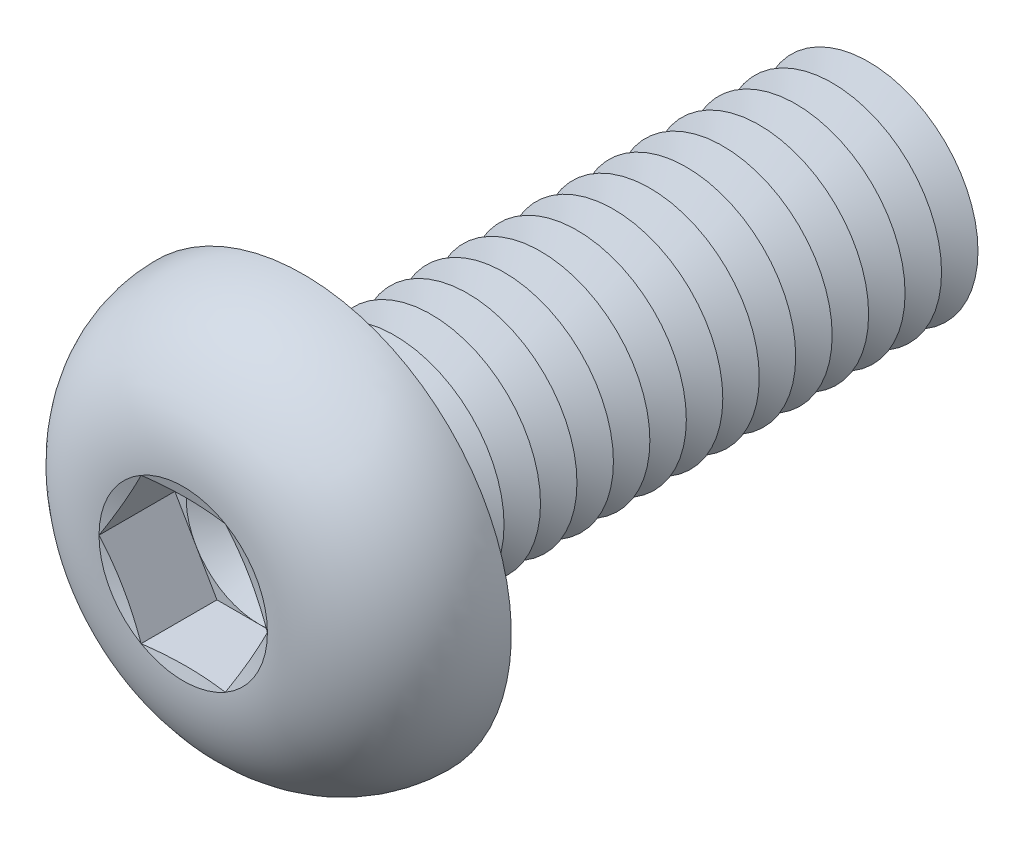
ISO-10303-21;
HEADER;
FILE_DESCRIPTION(('STEP AP214'),'2;1');
FILE_NAME('part.step','',(''),(''),'','','');
FILE_SCHEMA(('AUTOMOTIVE_DESIGN { 1 0 10303 214 1 1 1 1 }'));
ENDSEC;
DATA;
#1=APPLICATION_CONTEXT('core data for automotive mechanical design processes');
#2=APPLICATION_PROTOCOL_DEFINITION('international standard','automotive_design',2000,#1);
#3=PRODUCT_CONTEXT('',#1,'mechanical');
#4=PRODUCT('Part','Part','',(#3));
#5=PRODUCT_RELATED_PRODUCT_CATEGORY('part','',(#4));
#6=PRODUCT_DEFINITION_FORMATION('','',#4);
#7=PRODUCT_DEFINITION_CONTEXT('part definition',#1,'design');
#8=PRODUCT_DEFINITION('design','',#6,#7);
#9=PRODUCT_DEFINITION_SHAPE('','',#8);
#10=(LENGTH_UNIT() NAMED_UNIT(*) SI_UNIT(.MILLI.,.METRE.));
#11=(NAMED_UNIT(*) PLANE_ANGLE_UNIT() SI_UNIT($,.RADIAN.));
#12=(NAMED_UNIT(*) SI_UNIT($,.STERADIAN.) SOLID_ANGLE_UNIT());
#13=UNCERTAINTY_MEASURE_WITH_UNIT(LENGTH_MEASURE(1.E-05),#10,'distance_accuracy_value','');
#14=(GEOMETRIC_REPRESENTATION_CONTEXT(3) GLOBAL_UNCERTAINTY_ASSIGNED_CONTEXT((#13)) GLOBAL_UNIT_ASSIGNED_CONTEXT((#10,
#11,#12)) REPRESENTATION_CONTEXT('',''));
#15=CARTESIAN_POINT('',(0.,0.,0.));
#16=DIRECTION('',(0.,0.,1.));
#17=DIRECTION('',(1.,0.,0.));
#18=AXIS2_PLACEMENT_3D('',#15,#16,#17);
#19=CARTESIAN_POINT('',(0.,0.,0.609999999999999));
#20=DIRECTION('',(0.,0.,1.));
#21=DIRECTION('',(1.,0.,0.));
#22=AXIS2_PLACEMENT_3D('',#19,#20,#21);
#23=PLANE('',#22);
#24=CARTESIAN_POINT('',(0.,0.,0.609999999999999));
#25=DIRECTION('',(0.,0.,1.));
#26=DIRECTION('',(1.,0.,0.));
#27=AXIS2_PLACEMENT_3D('',#24,#25,#26);
#28=CIRCLE('',#27,0.999999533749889);
#29=CARTESIAN_POINT('',(0.866024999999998,0.499999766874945,0.609999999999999));
#30=VERTEX_POINT('',#29);
#31=CARTESIAN_POINT('',(0.,0.999999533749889,0.609999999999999));
#32=VERTEX_POINT('',#31);
#33=EDGE_CURVE('E118',#30,#32,#28,.T.);
#34=ORIENTED_EDGE('',*,*,#33,.F.);
#35=DIRECTION('',(-0.500000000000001,0.866025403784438,0.));
#36=VECTOR('',#35,1.);
#37=CARTESIAN_POINT('',(1.1547,0.,0.609999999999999));
#38=LINE('',#37,#36);
#39=CARTESIAN_POINT('',(0.577349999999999,0.999999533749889,0.609999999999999));
#40=VERTEX_POINT('',#39);
#41=EDGE_CURVE('E125',#30,#40,#38,.T.);
#42=ORIENTED_EDGE('',*,*,#41,.T.);
#43=DIRECTION('',(-1.,0.,0.));
#44=VECTOR('',#43,1.);
#45=CARTESIAN_POINT('',(0.577349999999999,0.999999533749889,0.609999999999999));
#46=LINE('',#45,#44);
#47=EDGE_CURVE('E136',#40,#32,#46,.T.);
#48=ORIENTED_EDGE('',*,*,#47,.T.);
#49=EDGE_LOOP('',(#34,#42,#48));
#50=FACE_BOUND('',#49,.T.);
#51=ADVANCED_FACE('F39',(#50),#23,.T.);
#52=CARTESIAN_POINT('',(0.,0.,0.609999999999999));
#53=DIRECTION('',(0.,0.,1.));
#54=DIRECTION('',(1.,0.,0.));
#55=AXIS2_PLACEMENT_3D('',#52,#53,#54);
#56=CIRCLE('',#55,0.999999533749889);
#57=CARTESIAN_POINT('',(-0.866024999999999,0.499999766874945,0.609999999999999));
#58=VERTEX_POINT('',#57);
#59=EDGE_CURVE('E11',#32,#58,#56,.T.);
#60=ORIENTED_EDGE('',*,*,#59,.F.);
#61=CARTESIAN_POINT('',(-0.577350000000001,0.999999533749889,0.609999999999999));
#62=VERTEX_POINT('',#61);
#63=EDGE_CURVE('E131',#32,#62,#46,.T.);
#64=ORIENTED_EDGE('',*,*,#63,.T.);
#65=DIRECTION('',(-0.5,-0.866025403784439,0.));
#66=VECTOR('',#65,1.);
#67=CARTESIAN_POINT('',(-0.577350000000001,0.999999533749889,0.609999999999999));
#68=LINE('',#67,#66);
#69=EDGE_CURVE('E134',#62,#58,#68,.T.);
#70=ORIENTED_EDGE('',*,*,#69,.T.);
#71=EDGE_LOOP('',(#60,#64,#70));
#72=FACE_BOUND('',#71,.T.);
#73=ADVANCED_FACE('F130',(#72),#23,.T.);
#74=CARTESIAN_POINT('',(-0.866024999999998,-0.499999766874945,0.609999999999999));
#75=VERTEX_POINT('',#74);
#76=EDGE_CURVE('E49',#58,#75,#56,.T.);
#77=ORIENTED_EDGE('',*,*,#76,.F.);
#78=CARTESIAN_POINT('',(-1.1547,0.,0.609999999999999));
#79=VERTEX_POINT('',#78);
#80=EDGE_CURVE('E143',#58,#79,#68,.T.);
#81=ORIENTED_EDGE('',*,*,#80,.T.);
#82=DIRECTION('',(0.5,-0.866025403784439,0.));
#83=VECTOR('',#82,1.);
#84=CARTESIAN_POINT('',(-1.1547,0.,0.609999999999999));
#85=LINE('',#84,#83);
#86=EDGE_CURVE('E152',#79,#75,#85,.T.);
#87=ORIENTED_EDGE('',*,*,#86,.T.);
#88=EDGE_LOOP('',(#77,#81,#87));
#89=FACE_BOUND('',#88,.T.);
#90=ADVANCED_FACE('F394',(#89),#23,.T.);
#91=CARTESIAN_POINT('',(0.,-0.999999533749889,0.609999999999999));
#92=VERTEX_POINT('',#91);
#93=EDGE_CURVE('E379',#75,#92,#56,.T.);
#94=ORIENTED_EDGE('',*,*,#93,.F.);
#95=CARTESIAN_POINT('',(-0.577349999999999,-0.99999953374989,0.609999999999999));
#96=VERTEX_POINT('',#95);
#97=EDGE_CURVE('E151',#75,#96,#85,.T.);
#98=ORIENTED_EDGE('',*,*,#97,.T.);
#99=DIRECTION('',(1.,0.,0.));
#100=VECTOR('',#99,1.);
#101=CARTESIAN_POINT('',(-0.577349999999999,-0.99999953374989,0.609999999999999));
#102=LINE('',#101,#100);
#103=EDGE_CURVE('E157',#96,#92,#102,.T.);
#104=ORIENTED_EDGE('',*,*,#103,.T.);
#105=EDGE_LOOP('',(#94,#98,#104));
#106=FACE_BOUND('',#105,.T.);
#107=ADVANCED_FACE('F387',(#106),#23,.T.);
#108=CARTESIAN_POINT('',(0.866024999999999,-0.499999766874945,0.609999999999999));
#109=VERTEX_POINT('',#108);
#110=EDGE_CURVE('E56',#92,#109,#56,.T.);
#111=ORIENTED_EDGE('',*,*,#110,.F.);
#112=CARTESIAN_POINT('',(0.577349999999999,-0.99999953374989,0.609999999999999));
#113=VERTEX_POINT('',#112);
#114=EDGE_CURVE('E156',#92,#113,#102,.T.);
#115=ORIENTED_EDGE('',*,*,#114,.T.);
#116=DIRECTION('',(0.5,0.866025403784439,0.));
#117=VECTOR('',#116,1.);
#118=CARTESIAN_POINT('',(0.577349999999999,-0.99999953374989,0.609999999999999));
#119=LINE('',#118,#117);
#120=EDGE_CURVE('E162',#113,#109,#119,.T.);
#121=ORIENTED_EDGE('',*,*,#120,.T.);
#122=EDGE_LOOP('',(#111,#115,#121));
#123=FACE_BOUND('',#122,.T.);
#124=ADVANCED_FACE('F462',(#123),#23,.T.);
#125=CARTESIAN_POINT('',(0.,0.,1.65));
#126=DIRECTION('',(0.,0.,1.));
#127=DIRECTION('',(1.,0.,0.));
#128=AXIS2_PLACEMENT_3D('',#125,#126,#127);
#129=CONICAL_SURFACE('',#128,1.1547,1.30899693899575);
#130=CARTESIAN_POINT('',(1.15481547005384,-0.000199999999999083,1.65003094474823));
#131=CARTESIAN_POINT('',(1.13083002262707,0.0413440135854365,1.64359970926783));
#132=CARTESIAN_POINT('',(1.10680107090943,0.0829633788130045,1.63776108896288));
#133=CARTESIAN_POINT('',(1.05865826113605,0.166349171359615,1.62750303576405));
#134=CARTESIAN_POINT('',(1.03454437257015,0.208115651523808,1.62308418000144));
#135=CARTESIAN_POINT('',(0.986377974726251,0.291542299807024,1.61592375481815));
#136=CARTESIAN_POINT('',(0.962325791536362,0.333201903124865,1.61317364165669));
#137=CARTESIAN_POINT('',(0.914190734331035,0.416574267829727,1.60948600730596));
#138=CARTESIAN_POINT('',(0.890107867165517,0.458287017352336,1.60854813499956));
#139=CARTESIAN_POINT('',(0.841942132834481,0.541712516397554,1.60854813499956));
#140=CARTESIAN_POINT('',(0.817859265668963,0.583425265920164,1.60948600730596));
#141=CARTESIAN_POINT('',(0.769724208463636,0.666797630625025,1.61317364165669));
#142=CARTESIAN_POINT('',(0.745672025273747,0.708457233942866,1.61592375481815));
#143=CARTESIAN_POINT('',(0.697505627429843,0.791883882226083,1.62308418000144));
#144=CARTESIAN_POINT('',(0.673391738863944,0.833650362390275,1.62750303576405));
#145=CARTESIAN_POINT('',(0.625248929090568,0.917036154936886,1.63776108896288));
#146=CARTESIAN_POINT('',(0.60121997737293,0.958655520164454,1.64359970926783));
#147=CARTESIAN_POINT('',(0.577234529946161,1.00019953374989,1.65003094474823));
#148=B_SPLINE_CURVE_WITH_KNOTS('',3,(#130,#131,#132,#133,#134,#135,#136,#137,#138,#139,#140,
#141,#142,#143,#144,#145,#146,#147),.UNSPECIFIED.,.F.,.F.,(4,2,2,2,2,2,2,2,4),(0.,
0.145207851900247,0.290474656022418,0.434991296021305,0.579479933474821,0.723968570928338,
0.868485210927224,1.0137520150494,1.15895986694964),.UNSPECIFIED.);
#149=CARTESIAN_POINT('',(1.1547,0.,1.65));
#150=VERTEX_POINT('',#149);
#151=CARTESIAN_POINT('',(0.57735,0.99999953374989,1.65));
#152=VERTEX_POINT('',#151);
#153=EDGE_CURVE('E221',#150,#152,#148,.T.);
#154=ORIENTED_EDGE('',*,*,#153,.F.);
#155=CARTESIAN_POINT('',(0.,0.,1.65));
#156=DIRECTION('',(0.,0.,-1.));
#157=DIRECTION('',(-1.,0.,0.));
#158=AXIS2_PLACEMENT_3D('',#155,#156,#157);
#159=CIRCLE('',#158,1.1547);
#160=EDGE_CURVE('E425',#152,#150,#159,.T.);
#161=ORIENTED_EDGE('',*,*,#160,.F.);
#162=EDGE_LOOP('',(#154,#161));
#163=FACE_BOUND('',#162,.T.);
#164=ADVANCED_FACE('F466',(#163),#129,.F.);
#165=CARTESIAN_POINT('',(0.577234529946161,-1.00019953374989,1.65003094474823));
#166=CARTESIAN_POINT('',(0.60121997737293,-0.958655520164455,1.64359970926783));
#167=CARTESIAN_POINT('',(0.625248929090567,-0.917036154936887,1.63776108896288));
#168=CARTESIAN_POINT('',(0.673391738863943,-0.833650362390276,1.62750303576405));
#169=CARTESIAN_POINT('',(0.697505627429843,-0.791883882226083,1.62308418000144));
#170=CARTESIAN_POINT('',(0.745672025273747,-0.708457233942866,1.61592375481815));
#171=CARTESIAN_POINT('',(0.769724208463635,-0.666797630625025,1.61317364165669));
#172=CARTESIAN_POINT('',(0.817859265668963,-0.583425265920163,1.60948600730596));
#173=CARTESIAN_POINT('',(0.84194213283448,-0.541712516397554,1.60854813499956));
#174=CARTESIAN_POINT('',(0.890107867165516,-0.458287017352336,1.60854813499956));
#175=CARTESIAN_POINT('',(0.914190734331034,-0.416574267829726,1.60948600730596));
#176=CARTESIAN_POINT('',(0.962325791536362,-0.333201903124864,1.61317364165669));
#177=CARTESIAN_POINT('',(0.98637797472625,-0.291542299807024,1.61592375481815));
#178=CARTESIAN_POINT('',(1.03454437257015,-0.208115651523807,1.62308418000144));
#179=CARTESIAN_POINT('',(1.05865826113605,-0.166349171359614,1.62750303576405));
#180=CARTESIAN_POINT('',(1.10680107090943,-0.0829633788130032,1.63776108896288));
#181=CARTESIAN_POINT('',(1.13083002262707,-0.0413440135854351,1.64359970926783));
#182=CARTESIAN_POINT('',(1.15481547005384,0.000200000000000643,1.65003094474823));
#183=B_SPLINE_CURVE_WITH_KNOTS('',3,(#165,#166,#167,#168,#169,#170,#171,#172,#173,#174,#175,
#176,#177,#178,#179,#180,#181,#182),.UNSPECIFIED.,.F.,.F.,(4,2,2,2,2,2,2,2,4),(0.,
0.145207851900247,0.290474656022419,0.434991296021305,0.579479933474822,0.723968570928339,
0.868485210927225,1.0137520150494,1.15895986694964),.UNSPECIFIED.);
#184=CARTESIAN_POINT('',(0.577349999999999,-0.99999953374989,1.65));
#185=VERTEX_POINT('',#184);
#186=EDGE_CURVE('E230',#185,#150,#183,.T.);
#187=ORIENTED_EDGE('',*,*,#186,.F.);
#188=EDGE_CURVE('E428',#150,#185,#159,.T.);
#189=ORIENTED_EDGE('',*,*,#188,.F.);
#190=EDGE_LOOP('',(#187,#189));
#191=FACE_BOUND('',#190,.T.);
#192=ADVANCED_FACE('F472',(#191),#129,.F.);
#193=CARTESIAN_POINT('',(-1.7425668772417,-0.99999953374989,1.87893949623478));
#194=CARTESIAN_POINT('',(-1.65819693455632,-0.99999953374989,1.85935934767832));
#195=CARTESIAN_POINT('',(-1.57375647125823,-0.99999953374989,1.84006351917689));
#196=CARTESIAN_POINT('',(-1.40464514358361,-0.99999953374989,1.80242908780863));
#197=CARTESIAN_POINT('',(-1.31997423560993,-0.99999953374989,1.78409068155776));
#198=CARTESIAN_POINT('',(-1.14955192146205,-0.99999953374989,1.74860242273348));
#199=CARTESIAN_POINT('',(-1.06379782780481,-0.99999953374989,1.73146532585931));
#200=CARTESIAN_POINT('',(-0.891887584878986,-0.99999953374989,1.69925819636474));
#201=CARTESIAN_POINT('',(-0.805731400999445,-0.99999953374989,1.68418834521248));
#202=CARTESIAN_POINT('',(-0.635256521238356,-0.99999953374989,1.65751615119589));
#203=CARTESIAN_POINT('',(-0.550951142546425,-0.99999953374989,1.64583105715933));
#204=CARTESIAN_POINT('',(-0.381865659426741,-0.99999953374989,1.62668811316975));
#205=CARTESIAN_POINT('',(-0.297085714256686,-0.99999953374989,1.61922892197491));
#206=CARTESIAN_POINT('',(-0.127577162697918,-0.99999953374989,1.60981453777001));
#207=CARTESIAN_POINT('',(-0.0428499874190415,-0.99999953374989,1.60783514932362));
#208=CARTESIAN_POINT('',(0.126542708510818,-0.99999953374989,1.60973012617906));
#209=CARTESIAN_POINT('',(0.211208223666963,-0.99999953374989,1.61360496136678));
#210=CARTESIAN_POINT('',(0.356115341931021,-0.99999953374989,1.62460226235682));
#211=CARTESIAN_POINT('',(0.416458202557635,-0.99999953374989,1.63048841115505));
#212=CARTESIAN_POINT('',(0.536893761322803,-0.99999953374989,1.64437752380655));
#213=CARTESIAN_POINT('',(0.596986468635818,-0.99999953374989,1.65238040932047));
#214=CARTESIAN_POINT('',(0.777275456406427,-0.99999953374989,1.67888855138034));
#215=CARTESIAN_POINT('',(0.897104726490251,-0.99999953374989,1.69985858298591));
#216=CARTESIAN_POINT('',(1.07751611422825,-0.99999953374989,1.73433574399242));
#217=CARTESIAN_POINT('',(1.1383777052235,-0.99999953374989,1.74646914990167));
#218=CARTESIAN_POINT('',(1.25994955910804,-0.99999953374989,1.7714845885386));
#219=CARTESIAN_POINT('',(1.32065982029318,-0.99999953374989,1.7843666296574));
#220=CARTESIAN_POINT('',(1.44162663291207,-0.99999953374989,1.81062164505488));
#221=CARTESIAN_POINT('',(1.50188385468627,-0.99999953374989,1.82399156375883));
#222=CARTESIAN_POINT('',(1.62229550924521,-0.99999953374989,1.85116781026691));
#223=CARTESIAN_POINT('',(1.68244994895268,-0.99999953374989,1.86497410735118));
#224=CARTESIAN_POINT('',(1.7425668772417,-0.99999953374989,1.87893949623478));
#225=B_SPLINE_CURVE_WITH_KNOTS('',3,(#193,#194,#195,#196,#197,#198,#199,#200,#201,#202,#203,
#204,#205,#206,#207,#208,#209,#210,#211,#212,#213,#214,#215,#216,#217,#218,#219,#220,#221,#222,
#223,#224),.UNSPECIFIED.,.F.,.F.,(4,2,2,2,2,2,2,2,2,2,2,2,2,2,2,4),(0.,0.259842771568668,
0.519738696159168,0.782071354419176,1.04442702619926,1.29968778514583,1.55486748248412,
1.80891865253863,2.06299021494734,2.24483732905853,2.42667771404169,2.79149503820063,
2.97767344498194,3.16385393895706,3.34902052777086,3.53417411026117),.UNSPECIFIED.);
#226=CARTESIAN_POINT('',(-0.577349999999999,-0.99999953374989,1.65));
#227=VERTEX_POINT('',#226);
#228=EDGE_CURVE('E406',#227,#185,#225,.T.);
#229=ORIENTED_EDGE('',*,*,#228,.F.);
#230=EDGE_CURVE('E414',#185,#227,#159,.T.);
#231=ORIENTED_EDGE('',*,*,#230,.F.);
#232=EDGE_LOOP('',(#229,#231));
#233=FACE_BOUND('',#232,.T.);
#234=ADVANCED_FACE('F487',(#233),#129,.F.);
#235=CARTESIAN_POINT('',(-1.15481547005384,0.000200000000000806,1.65003094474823));
#236=CARTESIAN_POINT('',(-1.13083002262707,-0.041344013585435,1.64359970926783));
#237=CARTESIAN_POINT('',(-1.10680107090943,-0.0829633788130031,1.63776108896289));
#238=CARTESIAN_POINT('',(-1.05865826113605,-0.166349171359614,1.62750303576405));
#239=CARTESIAN_POINT('',(-1.03454437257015,-0.208115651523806,1.62308418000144));
#240=CARTESIAN_POINT('',(-0.986377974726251,-0.291542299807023,1.61592375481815));
#241=CARTESIAN_POINT('',(-0.962325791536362,-0.333201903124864,1.61317364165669));
#242=CARTESIAN_POINT('',(-0.914190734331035,-0.416574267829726,1.60948600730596));
#243=CARTESIAN_POINT('',(-0.890107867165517,-0.458287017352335,1.60854813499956));
#244=CARTESIAN_POINT('',(-0.841942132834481,-0.541712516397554,1.60854813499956));
#245=CARTESIAN_POINT('',(-0.817859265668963,-0.583425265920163,1.60948600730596));
#246=CARTESIAN_POINT('',(-0.769724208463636,-0.666797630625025,1.61317364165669));
#247=CARTESIAN_POINT('',(-0.745672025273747,-0.708457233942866,1.61592375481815));
#248=CARTESIAN_POINT('',(-0.697505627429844,-0.791883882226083,1.62308418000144));
#249=CARTESIAN_POINT('',(-0.673391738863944,-0.833650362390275,1.62750303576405));
#250=CARTESIAN_POINT('',(-0.625248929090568,-0.917036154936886,1.63776108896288));
#251=CARTESIAN_POINT('',(-0.60121997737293,-0.958655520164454,1.64359970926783));
#252=CARTESIAN_POINT('',(-0.577234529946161,-1.00019953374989,1.65003094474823));
#253=B_SPLINE_CURVE_WITH_KNOTS('',3,(#235,#236,#237,#238,#239,#240,#241,#242,#243,#244,#245,
#246,#247,#248,#249,#250,#251,#252),.UNSPECIFIED.,.F.,.F.,(4,2,2,2,2,2,2,2,4),(0.,
0.145207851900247,0.290474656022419,0.434991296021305,0.579479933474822,0.723968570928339,
0.868485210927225,1.0137520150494,1.15895986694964),.UNSPECIFIED.);
#254=CARTESIAN_POINT('',(-1.1547,0.,1.65));
#255=VERTEX_POINT('',#254);
#256=EDGE_CURVE('E399',#255,#227,#253,.T.);
#257=ORIENTED_EDGE('',*,*,#256,.F.);
#258=EDGE_CURVE('E364',#227,#255,#159,.T.);
#259=ORIENTED_EDGE('',*,*,#258,.F.);
#260=EDGE_LOOP('',(#257,#259));
#261=FACE_BOUND('',#260,.T.);
#262=ADVANCED_FACE('F403',(#261),#129,.F.);
#263=CARTESIAN_POINT('',(-0.577234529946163,1.00019953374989,1.65003094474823));
#264=CARTESIAN_POINT('',(-0.601219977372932,0.958655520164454,1.64359970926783));
#265=CARTESIAN_POINT('',(-0.625248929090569,0.917036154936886,1.63776108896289));
#266=CARTESIAN_POINT('',(-0.673391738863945,0.833650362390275,1.62750303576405));
#267=CARTESIAN_POINT('',(-0.697505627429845,0.791883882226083,1.62308418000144));
#268=CARTESIAN_POINT('',(-0.745672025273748,0.708457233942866,1.61592375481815));
#269=CARTESIAN_POINT('',(-0.769724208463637,0.666797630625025,1.61317364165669));
#270=CARTESIAN_POINT('',(-0.817859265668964,0.583425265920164,1.60948600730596));
#271=CARTESIAN_POINT('',(-0.841942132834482,0.541712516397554,1.60854813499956));
#272=CARTESIAN_POINT('',(-0.890107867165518,0.458287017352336,1.60854813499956));
#273=CARTESIAN_POINT('',(-0.914190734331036,0.416574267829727,1.60948600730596));
#274=CARTESIAN_POINT('',(-0.962325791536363,0.333201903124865,1.61317364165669));
#275=CARTESIAN_POINT('',(-0.986377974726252,0.291542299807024,1.61592375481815));
#276=CARTESIAN_POINT('',(-1.03454437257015,0.208115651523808,1.62308418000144));
#277=CARTESIAN_POINT('',(-1.05865826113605,0.166349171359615,1.62750303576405));
#278=CARTESIAN_POINT('',(-1.10680107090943,0.0829633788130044,1.63776108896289));
#279=CARTESIAN_POINT('',(-1.13083002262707,0.0413440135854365,1.64359970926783));
#280=CARTESIAN_POINT('',(-1.15481547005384,-0.000199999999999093,1.65003094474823));
#281=B_SPLINE_CURVE_WITH_KNOTS('',3,(#263,#264,#265,#266,#267,#268,#269,#270,#271,#272,#273,
#274,#275,#276,#277,#278,#279,#280),.UNSPECIFIED.,.F.,.F.,(4,2,2,2,2,2,2,2,4),(0.,
0.145207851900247,0.290474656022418,0.434991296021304,0.579479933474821,0.723968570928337,
0.868485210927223,1.01375201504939,1.15895986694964),.UNSPECIFIED.);
#282=CARTESIAN_POINT('',(-0.577350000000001,0.999999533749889,1.65));
#283=VERTEX_POINT('',#282);
#284=EDGE_CURVE('E195',#283,#255,#281,.T.);
#285=ORIENTED_EDGE('',*,*,#284,.F.);
#286=EDGE_CURVE('E365',#255,#283,#159,.T.);
#287=ORIENTED_EDGE('',*,*,#286,.F.);
#288=EDGE_LOOP('',(#285,#287));
#289=FACE_BOUND('',#288,.T.);
#290=ADVANCED_FACE('F417',(#289),#129,.F.);
#291=CARTESIAN_POINT('',(0.,0.,-6.25));
#292=DIRECTION('',(0.,0.,1.));
#293=DIRECTION('',(1.,0.,0.));
#294=AXIS2_PLACEMENT_3D('',#291,#292,#293);
#295=CONICAL_SURFACE('',#294,1.5,1.0471975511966);
#296=CARTESIAN_POINT('',(0.,0.,-6.5));
#297=DIRECTION('',(0.,0.,1.));
#298=DIRECTION('',(1.,0.,0.));
#299=AXIS2_PLACEMENT_3D('',#296,#297,#298);
#300=CIRCLE('',#299,1.06698729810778);
#301=CARTESIAN_POINT('',(1.06698729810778,0.,-6.5));
#302=VERTEX_POINT('',#301);
#303=EDGE_CURVE('E336',#302,#302,#300,.T.);
#304=ORIENTED_EDGE('',*,*,#303,.T.);
#305=EDGE_LOOP('',(#304));
#306=FACE_BOUND('',#305,.T.);
#307=CARTESIAN_POINT('',(0.,0.,-6.25));
#308=DIRECTION('',(0.,0.,1.));
#309=DIRECTION('',(1.,0.,0.));
#310=AXIS2_PLACEMENT_3D('',#307,#308,#309);
#311=CIRCLE('',#310,1.5);
#312=CARTESIAN_POINT('',(1.5,0.,-6.25));
#313=VERTEX_POINT('',#312);
#314=EDGE_CURVE('E332',#313,#313,#311,.T.);
#315=ORIENTED_EDGE('',*,*,#314,.F.);
#316=EDGE_LOOP('',(#315));
#317=FACE_BOUND('',#316,.T.);
#318=ADVANCED_FACE('F553',(#306,#317),#295,.T.);
#319=CARTESIAN_POINT('',(0.,0.,-6.5));
#320=DIRECTION('',(0.,0.,-1.));
#321=DIRECTION('',(-1.,0.,0.));
#322=AXIS2_PLACEMENT_3D('',#319,#320,#321);
#323=CONICAL_SURFACE('',#322,1.06698729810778,1.0471975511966);
#324=CARTESIAN_POINT('',(0.,0.,-6.75));
#325=DIRECTION('',(0.,0.,1.));
#326=DIRECTION('',(1.,0.,0.));
#327=AXIS2_PLACEMENT_3D('',#324,#325,#326);
#328=CIRCLE('',#327,1.5);
#329=CARTESIAN_POINT('',(1.5,0.,-6.75));
#330=VERTEX_POINT('',#329);
#331=EDGE_CURVE('E340',#330,#330,#328,.T.);
#332=ORIENTED_EDGE('',*,*,#331,.T.);
#333=EDGE_LOOP('',(#332));
#334=FACE_BOUND('',#333,.T.);
#335=ORIENTED_EDGE('',*,*,#303,.F.);
#336=EDGE_LOOP('',(#335));
#337=FACE_BOUND('',#336,.T.);
#338=ADVANCED_FACE('F848',(#334,#337),#323,.T.);
#339=CARTESIAN_POINT('',(0.,1.5,-8.));
#340=DIRECTION('',(0.,0.,-1.));
#341=DIRECTION('',(-1.,0.,0.));
#342=AXIS2_PLACEMENT_3D('',#339,#340,#341);
#343=PLANE('',#342);
#344=CARTESIAN_POINT('',(0.,0.,-8.));
#345=DIRECTION('',(0.,0.,1.));
#346=DIRECTION('',(1.,0.,0.));
#347=AXIS2_PLACEMENT_3D('',#344,#345,#346);
#348=CIRCLE('',#347,1.06698729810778);
#349=CARTESIAN_POINT('',(1.06698729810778,0.,-8.));
#350=VERTEX_POINT('',#349);
#351=EDGE_CURVE('E360',#350,#350,#348,.T.);
#352=ORIENTED_EDGE('',*,*,#351,.F.);
#353=EDGE_LOOP('',(#352));
#354=FACE_BOUND('',#353,.T.);
#355=ADVANCED_FACE('F842',(#354),#343,.T.);
#356=CARTESIAN_POINT('',(0.,0.,-7.75));
#357=DIRECTION('',(0.,0.,1.));
#358=DIRECTION('',(1.,0.,0.));
#359=AXIS2_PLACEMENT_3D('',#356,#357,#358);
#360=CONICAL_SURFACE('',#359,1.5,1.0471975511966);
#361=ORIENTED_EDGE('',*,*,#351,.T.);
#362=EDGE_LOOP('',(#361));
#363=FACE_BOUND('',#362,.T.);
#364=CARTESIAN_POINT('',(0.,0.,-7.75));
#365=DIRECTION('',(0.,0.,1.));
#366=DIRECTION('',(1.,0.,0.));
#367=AXIS2_PLACEMENT_3D('',#364,#365,#366);
#368=CIRCLE('',#367,1.5);
#369=CARTESIAN_POINT('',(1.5,0.,-7.75));
#370=VERTEX_POINT('',#369);
#371=EDGE_CURVE('E356',#370,#370,#368,.T.);
#372=ORIENTED_EDGE('',*,*,#371,.F.);
#373=EDGE_LOOP('',(#372));
#374=FACE_BOUND('',#373,.T.);
#375=ADVANCED_FACE('F835',(#363,#374),#360,.T.);
#376=CARTESIAN_POINT('',(0.,0.,-7.5));
#377=DIRECTION('',(0.,0.,-1.));
#378=DIRECTION('',(-1.,0.,0.));
#379=AXIS2_PLACEMENT_3D('',#376,#377,#378);
#380=CONICAL_SURFACE('',#379,1.06698729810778,1.0471975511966);
#381=ORIENTED_EDGE('',*,*,#371,.T.);
#382=EDGE_LOOP('',(#381));
#383=FACE_BOUND('',#382,.T.);
#384=CARTESIAN_POINT('',(0.,0.,-7.5));
#385=DIRECTION('',(0.,0.,1.));
#386=DIRECTION('',(1.,0.,0.));
#387=AXIS2_PLACEMENT_3D('',#384,#385,#386);
#388=CIRCLE('',#387,1.06698729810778);
#389=CARTESIAN_POINT('',(1.06698729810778,0.,-7.5));
#390=VERTEX_POINT('',#389);
#391=EDGE_CURVE('E352',#390,#390,#388,.T.);
#392=ORIENTED_EDGE('',*,*,#391,.F.);
#393=EDGE_LOOP('',(#392));
#394=FACE_BOUND('',#393,.T.);
#395=ADVANCED_FACE('F828',(#383,#394),#380,.T.);
#396=CARTESIAN_POINT('',(0.,0.,-7.25));
#397=DIRECTION('',(0.,0.,1.));
#398=DIRECTION('',(1.,0.,0.));
#399=AXIS2_PLACEMENT_3D('',#396,#397,#398);
#400=CONICAL_SURFACE('',#399,1.5,1.0471975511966);
#401=ORIENTED_EDGE('',*,*,#391,.T.);
#402=EDGE_LOOP('',(#401));
#403=FACE_BOUND('',#402,.T.);
#404=CARTESIAN_POINT('',(0.,0.,-7.25));
#405=DIRECTION('',(0.,0.,1.));
#406=DIRECTION('',(1.,0.,0.));
#407=AXIS2_PLACEMENT_3D('',#404,#405,#406);
#408=CIRCLE('',#407,1.5);
#409=CARTESIAN_POINT('',(1.5,0.,-7.25));
#410=VERTEX_POINT('',#409);
#411=EDGE_CURVE('E348',#410,#410,#408,.T.);
#412=ORIENTED_EDGE('',*,*,#411,.F.);
#413=EDGE_LOOP('',(#412));
#414=FACE_BOUND('',#413,.T.);
#415=ADVANCED_FACE('F821',(#403,#414),#400,.T.);
#416=CARTESIAN_POINT('',(0.,0.,-7.));
#417=DIRECTION('',(0.,0.,-1.));
#418=DIRECTION('',(-1.,0.,0.));
#419=AXIS2_PLACEMENT_3D('',#416,#417,#418);
#420=CONICAL_SURFACE('',#419,1.06698729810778,1.0471975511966);
#421=ORIENTED_EDGE('',*,*,#411,.T.);
#422=EDGE_LOOP('',(#421));
#423=FACE_BOUND('',#422,.T.);
#424=CARTESIAN_POINT('',(0.,0.,-7.));
#425=DIRECTION('',(0.,0.,1.));
#426=DIRECTION('',(1.,0.,0.));
#427=AXIS2_PLACEMENT_3D('',#424,#425,#426);
#428=CIRCLE('',#427,1.06698729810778);
#429=CARTESIAN_POINT('',(1.06698729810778,0.,-7.));
#430=VERTEX_POINT('',#429);
#431=EDGE_CURVE('E344',#430,#430,#428,.T.);
#432=ORIENTED_EDGE('',*,*,#431,.F.);
#433=EDGE_LOOP('',(#432));
#434=FACE_BOUND('',#433,.T.);
#435=ADVANCED_FACE('F814',(#423,#434),#420,.T.);
#436=CARTESIAN_POINT('',(0.,0.,-6.75));
#437=DIRECTION('',(0.,0.,1.));
#438=DIRECTION('',(1.,0.,0.));
#439=AXIS2_PLACEMENT_3D('',#436,#437,#438);
#440=CONICAL_SURFACE('',#439,1.5,1.0471975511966);
#441=ORIENTED_EDGE('',*,*,#431,.T.);
#442=EDGE_LOOP('',(#441));
#443=FACE_BOUND('',#442,.T.);
#444=ORIENTED_EDGE('',*,*,#331,.F.);
#445=EDGE_LOOP('',(#444));
#446=FACE_BOUND('',#445,.T.);
#447=ADVANCED_FACE('F807',(#443,#446),#440,.T.);
#448=CARTESIAN_POINT('',(0.,0.,-5.75));
#449=DIRECTION('',(0.,0.,1.));
#450=DIRECTION('',(1.,0.,0.));
#451=AXIS2_PLACEMENT_3D('',#448,#449,#450);
#452=CONICAL_SURFACE('',#451,1.5,1.0471975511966);
#453=CARTESIAN_POINT('',(0.,0.,-6.));
#454=DIRECTION('',(0.,0.,1.));
#455=DIRECTION('',(1.,0.,0.));
#456=AXIS2_PLACEMENT_3D('',#453,#454,#455);
#457=CIRCLE('',#456,1.06698729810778);
#458=CARTESIAN_POINT('',(1.06698729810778,0.,-6.));
#459=VERTEX_POINT('',#458);
#460=EDGE_CURVE('E328',#459,#459,#457,.T.);
#461=ORIENTED_EDGE('',*,*,#460,.T.);
#462=EDGE_LOOP('',(#461));
#463=FACE_BOUND('',#462,.T.);
#464=CARTESIAN_POINT('',(0.,0.,-5.75));
#465=DIRECTION('',(0.,0.,1.));
#466=DIRECTION('',(1.,0.,0.));
#467=AXIS2_PLACEMENT_3D('',#464,#465,#466);
#468=CIRCLE('',#467,1.5);
#469=CARTESIAN_POINT('',(1.5,0.,-5.75));
#470=VERTEX_POINT('',#469);
#471=EDGE_CURVE('E324',#470,#470,#468,.T.);
#472=ORIENTED_EDGE('',*,*,#471,.F.);
#473=EDGE_LOOP('',(#472));
#474=FACE_BOUND('',#473,.T.);
#475=ADVANCED_FACE('F800',(#463,#474),#452,.T.);
#476=CARTESIAN_POINT('',(0.,0.,-6.));
#477=DIRECTION('',(0.,0.,-1.));
#478=DIRECTION('',(-1.,0.,0.));
#479=AXIS2_PLACEMENT_3D('',#476,#477,#478);
#480=CONICAL_SURFACE('',#479,1.06698729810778,1.0471975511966);
#481=ORIENTED_EDGE('',*,*,#314,.T.);
#482=EDGE_LOOP('',(#481));
#483=FACE_BOUND('',#482,.T.);
#484=ORIENTED_EDGE('',*,*,#460,.F.);
#485=EDGE_LOOP('',(#484));
#486=FACE_BOUND('',#485,.T.);
#487=ADVANCED_FACE('F793',(#483,#486),#480,.T.);
#488=CARTESIAN_POINT('',(0.,0.,-5.25));
#489=DIRECTION('',(0.,0.,1.));
#490=DIRECTION('',(1.,0.,0.));
#491=AXIS2_PLACEMENT_3D('',#488,#489,#490);
#492=CONICAL_SURFACE('',#491,1.5,1.0471975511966);
#493=CARTESIAN_POINT('',(0.,0.,-5.5));
#494=DIRECTION('',(0.,0.,1.));
#495=DIRECTION('',(1.,0.,0.));
#496=AXIS2_PLACEMENT_3D('',#493,#494,#495);
#497=CIRCLE('',#496,1.06698729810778);
#498=CARTESIAN_POINT('',(1.06698729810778,0.,-5.5));
#499=VERTEX_POINT('',#498);
#500=EDGE_CURVE('E320',#499,#499,#497,.T.);
#501=ORIENTED_EDGE('',*,*,#500,.T.);
#502=EDGE_LOOP('',(#501));
#503=FACE_BOUND('',#502,.T.);
#504=CARTESIAN_POINT('',(0.,0.,-5.25));
#505=DIRECTION('',(0.,0.,1.));
#506=DIRECTION('',(1.,0.,0.));
#507=AXIS2_PLACEMENT_3D('',#504,#505,#506);
#508=CIRCLE('',#507,1.5);
#509=CARTESIAN_POINT('',(1.5,0.,-5.25));
#510=VERTEX_POINT('',#509);
#511=EDGE_CURVE('E316',#510,#510,#508,.T.);
#512=ORIENTED_EDGE('',*,*,#511,.F.);
#513=EDGE_LOOP('',(#512));
#514=FACE_BOUND('',#513,.T.);
#515=ADVANCED_FACE('F786',(#503,#514),#492,.T.);
#516=CARTESIAN_POINT('',(0.,0.,-5.5));
#517=DIRECTION('',(0.,0.,-1.));
#518=DIRECTION('',(-1.,0.,0.));
#519=AXIS2_PLACEMENT_3D('',#516,#517,#518);
#520=CONICAL_SURFACE('',#519,1.06698729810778,1.0471975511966);
#521=ORIENTED_EDGE('',*,*,#471,.T.);
#522=EDGE_LOOP('',(#521));
#523=FACE_BOUND('',#522,.T.);
#524=ORIENTED_EDGE('',*,*,#500,.F.);
#525=EDGE_LOOP('',(#524));
#526=FACE_BOUND('',#525,.T.);
#527=ADVANCED_FACE('F779',(#523,#526),#520,.T.);
#528=CARTESIAN_POINT('',(0.,0.,-4.75));
#529=DIRECTION('',(0.,0.,1.));
#530=DIRECTION('',(1.,0.,0.));
#531=AXIS2_PLACEMENT_3D('',#528,#529,#530);
#532=CONICAL_SURFACE('',#531,1.5,1.0471975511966);
#533=CARTESIAN_POINT('',(0.,0.,-5.));
#534=DIRECTION('',(0.,0.,1.));
#535=DIRECTION('',(1.,0.,0.));
#536=AXIS2_PLACEMENT_3D('',#533,#534,#535);
#537=CIRCLE('',#536,1.06698729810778);
#538=CARTESIAN_POINT('',(1.06698729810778,0.,-5.));
#539=VERTEX_POINT('',#538);
#540=EDGE_CURVE('E312',#539,#539,#537,.T.);
#541=ORIENTED_EDGE('',*,*,#540,.T.);
#542=EDGE_LOOP('',(#541));
#543=FACE_BOUND('',#542,.T.);
#544=CARTESIAN_POINT('',(0.,0.,-4.75));
#545=DIRECTION('',(0.,0.,1.));
#546=DIRECTION('',(1.,0.,0.));
#547=AXIS2_PLACEMENT_3D('',#544,#545,#546);
#548=CIRCLE('',#547,1.5);
#549=CARTESIAN_POINT('',(1.5,0.,-4.75));
#550=VERTEX_POINT('',#549);
#551=EDGE_CURVE('E308',#550,#550,#548,.T.);
#552=ORIENTED_EDGE('',*,*,#551,.F.);
#553=EDGE_LOOP('',(#552));
#554=FACE_BOUND('',#553,.T.);
#555=ADVANCED_FACE('F772',(#543,#554),#532,.T.);
#556=CARTESIAN_POINT('',(0.,0.,-5.));
#557=DIRECTION('',(0.,0.,-1.));
#558=DIRECTION('',(-1.,0.,0.));
#559=AXIS2_PLACEMENT_3D('',#556,#557,#558);
#560=CONICAL_SURFACE('',#559,1.06698729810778,1.0471975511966);
#561=ORIENTED_EDGE('',*,*,#511,.T.);
#562=EDGE_LOOP('',(#561));
#563=FACE_BOUND('',#562,.T.);
#564=ORIENTED_EDGE('',*,*,#540,.F.);
#565=EDGE_LOOP('',(#564));
#566=FACE_BOUND('',#565,.T.);
#567=ADVANCED_FACE('F765',(#563,#566),#560,.T.);
#568=CARTESIAN_POINT('',(0.,0.,-4.25));
#569=DIRECTION('',(0.,0.,1.));
#570=DIRECTION('',(1.,0.,0.));
#571=AXIS2_PLACEMENT_3D('',#568,#569,#570);
#572=CONICAL_SURFACE('',#571,1.5,1.0471975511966);
#573=CARTESIAN_POINT('',(0.,0.,-4.5));
#574=DIRECTION('',(0.,0.,1.));
#575=DIRECTION('',(1.,0.,0.));
#576=AXIS2_PLACEMENT_3D('',#573,#574,#575);
#577=CIRCLE('',#576,1.06698729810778);
#578=CARTESIAN_POINT('',(1.06698729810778,0.,-4.5));
#579=VERTEX_POINT('',#578);
#580=EDGE_CURVE('E304',#579,#579,#577,.T.);
#581=ORIENTED_EDGE('',*,*,#580,.T.);
#582=EDGE_LOOP('',(#581));
#583=FACE_BOUND('',#582,.T.);
#584=CARTESIAN_POINT('',(0.,0.,-4.25));
#585=DIRECTION('',(0.,0.,1.));
#586=DIRECTION('',(1.,0.,0.));
#587=AXIS2_PLACEMENT_3D('',#584,#585,#586);
#588=CIRCLE('',#587,1.5);
#589=CARTESIAN_POINT('',(1.5,0.,-4.25));
#590=VERTEX_POINT('',#589);
#591=EDGE_CURVE('E300',#590,#590,#588,.T.);
#592=ORIENTED_EDGE('',*,*,#591,.F.);
#593=EDGE_LOOP('',(#592));
#594=FACE_BOUND('',#593,.T.);
#595=ADVANCED_FACE('F758',(#583,#594),#572,.T.);
#596=CARTESIAN_POINT('',(0.,0.,-4.5));
#597=DIRECTION('',(0.,0.,-1.));
#598=DIRECTION('',(-1.,0.,0.));
#599=AXIS2_PLACEMENT_3D('',#596,#597,#598);
#600=CONICAL_SURFACE('',#599,1.06698729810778,1.0471975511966);
#601=ORIENTED_EDGE('',*,*,#551,.T.);
#602=EDGE_LOOP('',(#601));
#603=FACE_BOUND('',#602,.T.);
#604=ORIENTED_EDGE('',*,*,#580,.F.);
#605=EDGE_LOOP('',(#604));
#606=FACE_BOUND('',#605,.T.);
#607=ADVANCED_FACE('F751',(#603,#606),#600,.T.);
#608=CARTESIAN_POINT('',(0.,0.,-3.75));
#609=DIRECTION('',(0.,0.,1.));
#610=DIRECTION('',(1.,0.,0.));
#611=AXIS2_PLACEMENT_3D('',#608,#609,#610);
#612=CONICAL_SURFACE('',#611,1.5,1.0471975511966);
#613=CARTESIAN_POINT('',(0.,0.,-4.));
#614=DIRECTION('',(0.,0.,1.));
#615=DIRECTION('',(1.,0.,0.));
#616=AXIS2_PLACEMENT_3D('',#613,#614,#615);
#617=CIRCLE('',#616,1.06698729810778);
#618=CARTESIAN_POINT('',(1.06698729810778,0.,-4.));
#619=VERTEX_POINT('',#618);
#620=EDGE_CURVE('E296',#619,#619,#617,.T.);
#621=ORIENTED_EDGE('',*,*,#620,.T.);
#622=EDGE_LOOP('',(#621));
#623=FACE_BOUND('',#622,.T.);
#624=CARTESIAN_POINT('',(0.,0.,-3.75));
#625=DIRECTION('',(0.,0.,1.));
#626=DIRECTION('',(1.,0.,0.));
#627=AXIS2_PLACEMENT_3D('',#624,#625,#626);
#628=CIRCLE('',#627,1.5);
#629=CARTESIAN_POINT('',(1.5,0.,-3.75));
#630=VERTEX_POINT('',#629);
#631=EDGE_CURVE('E292',#630,#630,#628,.T.);
#632=ORIENTED_EDGE('',*,*,#631,.F.);
#633=EDGE_LOOP('',(#632));
#634=FACE_BOUND('',#633,.T.);
#635=ADVANCED_FACE('F744',(#623,#634),#612,.T.);
#636=CARTESIAN_POINT('',(0.,0.,-4.));
#637=DIRECTION('',(0.,0.,-1.));
#638=DIRECTION('',(-1.,0.,0.));
#639=AXIS2_PLACEMENT_3D('',#636,#637,#638);
#640=CONICAL_SURFACE('',#639,1.06698729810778,1.0471975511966);
#641=ORIENTED_EDGE('',*,*,#591,.T.);
#642=EDGE_LOOP('',(#641));
#643=FACE_BOUND('',#642,.T.);
#644=ORIENTED_EDGE('',*,*,#620,.F.);
#645=EDGE_LOOP('',(#644));
#646=FACE_BOUND('',#645,.T.);
#647=ADVANCED_FACE('F737',(#643,#646),#640,.T.);
#648=CARTESIAN_POINT('',(0.,0.,-3.25));
#649=DIRECTION('',(0.,0.,1.));
#650=DIRECTION('',(1.,0.,0.));
#651=AXIS2_PLACEMENT_3D('',#648,#649,#650);
#652=CONICAL_SURFACE('',#651,1.5,1.0471975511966);
#653=CARTESIAN_POINT('',(0.,0.,-3.5));
#654=DIRECTION('',(0.,0.,1.));
#655=DIRECTION('',(1.,0.,0.));
#656=AXIS2_PLACEMENT_3D('',#653,#654,#655);
#657=CIRCLE('',#656,1.06698729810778);
#658=CARTESIAN_POINT('',(1.06698729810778,0.,-3.5));
#659=VERTEX_POINT('',#658);
#660=EDGE_CURVE('E288',#659,#659,#657,.T.);
#661=ORIENTED_EDGE('',*,*,#660,.T.);
#662=EDGE_LOOP('',(#661));
#663=FACE_BOUND('',#662,.T.);
#664=CARTESIAN_POINT('',(0.,0.,-3.25));
#665=DIRECTION('',(0.,0.,1.));
#666=DIRECTION('',(1.,0.,0.));
#667=AXIS2_PLACEMENT_3D('',#664,#665,#666);
#668=CIRCLE('',#667,1.5);
#669=CARTESIAN_POINT('',(1.5,0.,-3.25));
#670=VERTEX_POINT('',#669);
#671=EDGE_CURVE('E284',#670,#670,#668,.T.);
#672=ORIENTED_EDGE('',*,*,#671,.F.);
#673=EDGE_LOOP('',(#672));
#674=FACE_BOUND('',#673,.T.);
#675=ADVANCED_FACE('F730',(#663,#674),#652,.T.);
#676=CARTESIAN_POINT('',(0.,0.,-3.5));
#677=DIRECTION('',(0.,0.,-1.));
#678=DIRECTION('',(-1.,0.,0.));
#679=AXIS2_PLACEMENT_3D('',#676,#677,#678);
#680=CONICAL_SURFACE('',#679,1.06698729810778,1.0471975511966);
#681=ORIENTED_EDGE('',*,*,#631,.T.);
#682=EDGE_LOOP('',(#681));
#683=FACE_BOUND('',#682,.T.);
#684=ORIENTED_EDGE('',*,*,#660,.F.);
#685=EDGE_LOOP('',(#684));
#686=FACE_BOUND('',#685,.T.);
#687=ADVANCED_FACE('F723',(#683,#686),#680,.T.);
#688=CARTESIAN_POINT('',(0.,0.,-2.75));
#689=DIRECTION('',(0.,0.,1.));
#690=DIRECTION('',(1.,0.,0.));
#691=AXIS2_PLACEMENT_3D('',#688,#689,#690);
#692=CONICAL_SURFACE('',#691,1.5,1.0471975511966);
#693=CARTESIAN_POINT('',(0.,0.,-3.));
#694=DIRECTION('',(0.,0.,1.));
#695=DIRECTION('',(1.,0.,0.));
#696=AXIS2_PLACEMENT_3D('',#693,#694,#695);
#697=CIRCLE('',#696,1.06698729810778);
#698=CARTESIAN_POINT('',(1.06698729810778,0.,-3.));
#699=VERTEX_POINT('',#698);
#700=EDGE_CURVE('E280',#699,#699,#697,.T.);
#701=ORIENTED_EDGE('',*,*,#700,.T.);
#702=EDGE_LOOP('',(#701));
#703=FACE_BOUND('',#702,.T.);
#704=CARTESIAN_POINT('',(0.,0.,-2.75));
#705=DIRECTION('',(0.,0.,1.));
#706=DIRECTION('',(1.,0.,0.));
#707=AXIS2_PLACEMENT_3D('',#704,#705,#706);
#708=CIRCLE('',#707,1.5);
#709=CARTESIAN_POINT('',(1.5,0.,-2.75));
#710=VERTEX_POINT('',#709);
#711=EDGE_CURVE('E276',#710,#710,#708,.T.);
#712=ORIENTED_EDGE('',*,*,#711,.F.);
#713=EDGE_LOOP('',(#712));
#714=FACE_BOUND('',#713,.T.);
#715=ADVANCED_FACE('F716',(#703,#714),#692,.T.);
#716=CARTESIAN_POINT('',(0.,0.,-3.));
#717=DIRECTION('',(0.,0.,-1.));
#718=DIRECTION('',(-1.,0.,0.));
#719=AXIS2_PLACEMENT_3D('',#716,#717,#718);
#720=CONICAL_SURFACE('',#719,1.06698729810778,1.0471975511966);
#721=ORIENTED_EDGE('',*,*,#671,.T.);
#722=EDGE_LOOP('',(#721));
#723=FACE_BOUND('',#722,.T.);
#724=ORIENTED_EDGE('',*,*,#700,.F.);
#725=EDGE_LOOP('',(#724));
#726=FACE_BOUND('',#725,.T.);
#727=ADVANCED_FACE('F709',(#723,#726),#720,.T.);
#728=CARTESIAN_POINT('',(0.,0.,-2.25));
#729=DIRECTION('',(0.,0.,1.));
#730=DIRECTION('',(1.,0.,0.));
#731=AXIS2_PLACEMENT_3D('',#728,#729,#730);
#732=CONICAL_SURFACE('',#731,1.5,1.0471975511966);
#733=CARTESIAN_POINT('',(0.,0.,-2.5));
#734=DIRECTION('',(0.,0.,1.));
#735=DIRECTION('',(1.,0.,0.));
#736=AXIS2_PLACEMENT_3D('',#733,#734,#735);
#737=CIRCLE('',#736,1.06698729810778);
#738=CARTESIAN_POINT('',(1.06698729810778,0.,-2.5));
#739=VERTEX_POINT('',#738);
#740=EDGE_CURVE('E272',#739,#739,#737,.T.);
#741=ORIENTED_EDGE('',*,*,#740,.T.);
#742=EDGE_LOOP('',(#741));
#743=FACE_BOUND('',#742,.T.);
#744=CARTESIAN_POINT('',(0.,0.,-2.25));
#745=DIRECTION('',(0.,0.,1.));
#746=DIRECTION('',(1.,0.,0.));
#747=AXIS2_PLACEMENT_3D('',#744,#745,#746);
#748=CIRCLE('',#747,1.5);
#749=CARTESIAN_POINT('',(1.5,0.,-2.25));
#750=VERTEX_POINT('',#749);
#751=EDGE_CURVE('E268',#750,#750,#748,.T.);
#752=ORIENTED_EDGE('',*,*,#751,.F.);
#753=EDGE_LOOP('',(#752));
#754=FACE_BOUND('',#753,.T.);
#755=ADVANCED_FACE('F702',(#743,#754),#732,.T.);
#756=CARTESIAN_POINT('',(0.,0.,-2.5));
#757=DIRECTION('',(0.,0.,-1.));
#758=DIRECTION('',(-1.,0.,0.));
#759=AXIS2_PLACEMENT_3D('',#756,#757,#758);
#760=CONICAL_SURFACE('',#759,1.06698729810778,1.0471975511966);
#761=ORIENTED_EDGE('',*,*,#711,.T.);
#762=EDGE_LOOP('',(#761));
#763=FACE_BOUND('',#762,.T.);
#764=ORIENTED_EDGE('',*,*,#740,.F.);
#765=EDGE_LOOP('',(#764));
#766=FACE_BOUND('',#765,.T.);
#767=ADVANCED_FACE('F695',(#763,#766),#760,.T.);
#768=CARTESIAN_POINT('',(0.,0.,-1.75));
#769=DIRECTION('',(0.,0.,1.));
#770=DIRECTION('',(1.,0.,0.));
#771=AXIS2_PLACEMENT_3D('',#768,#769,#770);
#772=CONICAL_SURFACE('',#771,1.5,1.0471975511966);
#773=CARTESIAN_POINT('',(0.,0.,-2.));
#774=DIRECTION('',(0.,0.,1.));
#775=DIRECTION('',(1.,0.,0.));
#776=AXIS2_PLACEMENT_3D('',#773,#774,#775);
#777=CIRCLE('',#776,1.06698729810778);
#778=CARTESIAN_POINT('',(1.06698729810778,0.,-2.));
#779=VERTEX_POINT('',#778);
#780=EDGE_CURVE('E264',#779,#779,#777,.T.);
#781=ORIENTED_EDGE('',*,*,#780,.T.);
#782=EDGE_LOOP('',(#781));
#783=FACE_BOUND('',#782,.T.);
#784=CARTESIAN_POINT('',(0.,0.,-1.75));
#785=DIRECTION('',(0.,0.,1.));
#786=DIRECTION('',(1.,0.,0.));
#787=AXIS2_PLACEMENT_3D('',#784,#785,#786);
#788=CIRCLE('',#787,1.5);
#789=CARTESIAN_POINT('',(1.5,0.,-1.75));
#790=VERTEX_POINT('',#789);
#791=EDGE_CURVE('E260',#790,#790,#788,.T.);
#792=ORIENTED_EDGE('',*,*,#791,.F.);
#793=EDGE_LOOP('',(#792));
#794=FACE_BOUND('',#793,.T.);
#795=ADVANCED_FACE('F688',(#783,#794),#772,.T.);
#796=CARTESIAN_POINT('',(0.,0.,-2.));
#797=DIRECTION('',(0.,0.,-1.));
#798=DIRECTION('',(-1.,0.,0.));
#799=AXIS2_PLACEMENT_3D('',#796,#797,#798);
#800=CONICAL_SURFACE('',#799,1.06698729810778,1.0471975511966);
#801=ORIENTED_EDGE('',*,*,#751,.T.);
#802=EDGE_LOOP('',(#801));
#803=FACE_BOUND('',#802,.T.);
#804=ORIENTED_EDGE('',*,*,#780,.F.);
#805=EDGE_LOOP('',(#804));
#806=FACE_BOUND('',#805,.T.);
#807=ADVANCED_FACE('F681',(#803,#806),#800,.T.);
#808=CARTESIAN_POINT('',(0.,0.,-1.25));
#809=DIRECTION('',(0.,0.,1.));
#810=DIRECTION('',(1.,0.,0.));
#811=AXIS2_PLACEMENT_3D('',#808,#809,#810);
#812=CONICAL_SURFACE('',#811,1.5,1.0471975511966);
#813=CARTESIAN_POINT('',(0.,0.,-1.5));
#814=DIRECTION('',(0.,0.,1.));
#815=DIRECTION('',(1.,0.,0.));
#816=AXIS2_PLACEMENT_3D('',#813,#814,#815);
#817=CIRCLE('',#816,1.06698729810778);
#818=CARTESIAN_POINT('',(1.06698729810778,0.,-1.5));
#819=VERTEX_POINT('',#818);
#820=EDGE_CURVE('E256',#819,#819,#817,.T.);
#821=ORIENTED_EDGE('',*,*,#820,.T.);
#822=EDGE_LOOP('',(#821));
#823=FACE_BOUND('',#822,.T.);
#824=CARTESIAN_POINT('',(0.,0.,-1.25));
#825=DIRECTION('',(0.,0.,1.));
#826=DIRECTION('',(1.,0.,0.));
#827=AXIS2_PLACEMENT_3D('',#824,#825,#826);
#828=CIRCLE('',#827,1.5);
#829=CARTESIAN_POINT('',(1.5,0.,-1.25));
#830=VERTEX_POINT('',#829);
#831=EDGE_CURVE('E252',#830,#830,#828,.T.);
#832=ORIENTED_EDGE('',*,*,#831,.F.);
#833=EDGE_LOOP('',(#832));
#834=FACE_BOUND('',#833,.T.);
#835=ADVANCED_FACE('F674',(#823,#834),#812,.T.);
#836=CARTESIAN_POINT('',(0.,0.,-1.5));
#837=DIRECTION('',(0.,0.,-1.));
#838=DIRECTION('',(-1.,0.,0.));
#839=AXIS2_PLACEMENT_3D('',#836,#837,#838);
#840=CONICAL_SURFACE('',#839,1.06698729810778,1.0471975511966);
#841=ORIENTED_EDGE('',*,*,#791,.T.);
#842=EDGE_LOOP('',(#841));
#843=FACE_BOUND('',#842,.T.);
#844=ORIENTED_EDGE('',*,*,#820,.F.);
#845=EDGE_LOOP('',(#844));
#846=FACE_BOUND('',#845,.T.);
#847=ADVANCED_FACE('F667',(#843,#846),#840,.T.);
#848=CARTESIAN_POINT('',(0.,0.,-0.75));
#849=DIRECTION('',(0.,0.,1.));
#850=DIRECTION('',(1.,0.,0.));
#851=AXIS2_PLACEMENT_3D('',#848,#849,#850);
#852=CONICAL_SURFACE('',#851,1.5,1.0471975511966);
#853=CARTESIAN_POINT('',(0.,0.,-1.));
#854=DIRECTION('',(0.,0.,1.));
#855=DIRECTION('',(1.,0.,0.));
#856=AXIS2_PLACEMENT_3D('',#853,#854,#855);
#857=CIRCLE('',#856,1.06698729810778);
#858=CARTESIAN_POINT('',(1.06698729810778,0.,-1.));
#859=VERTEX_POINT('',#858);
#860=EDGE_CURVE('E248',#859,#859,#857,.T.);
#861=ORIENTED_EDGE('',*,*,#860,.T.);
#862=EDGE_LOOP('',(#861));
#863=FACE_BOUND('',#862,.T.);
#864=CARTESIAN_POINT('',(0.,0.,-0.750000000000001));
#865=DIRECTION('',(0.,0.,1.));
#866=DIRECTION('',(1.,0.,0.));
#867=AXIS2_PLACEMENT_3D('',#864,#865,#866);
#868=CIRCLE('',#867,1.5);
#869=CARTESIAN_POINT('',(1.5,0.,-0.750000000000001));
#870=VERTEX_POINT('',#869);
#871=EDGE_CURVE('E240',#870,#870,#868,.T.);
#872=ORIENTED_EDGE('',*,*,#871,.F.);
#873=EDGE_LOOP('',(#872));
#874=FACE_BOUND('',#873,.T.);
#875=ADVANCED_FACE('F660',(#863,#874),#852,.T.);
#876=CARTESIAN_POINT('',(0.,0.,-1.));
#877=DIRECTION('',(0.,0.,-1.));
#878=DIRECTION('',(-1.,0.,0.));
#879=AXIS2_PLACEMENT_3D('',#876,#877,#878);
#880=CONICAL_SURFACE('',#879,1.06698729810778,1.0471975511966);
#881=ORIENTED_EDGE('',*,*,#831,.T.);
#882=EDGE_LOOP('',(#881));
#883=FACE_BOUND('',#882,.T.);
#884=ORIENTED_EDGE('',*,*,#860,.F.);
#885=EDGE_LOOP('',(#884));
#886=FACE_BOUND('',#885,.T.);
#887=ADVANCED_FACE('F654',(#883,#886),#880,.T.);
#888=CARTESIAN_POINT('',(0.,0.,-0.25));
#889=DIRECTION('',(0.,0.,1.));
#890=DIRECTION('',(1.,0.,0.));
#891=AXIS2_PLACEMENT_3D('',#888,#889,#890);
#892=CONICAL_SURFACE('',#891,1.5,1.0471975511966);
#893=CARTESIAN_POINT('',(0.,0.,-0.5));
#894=DIRECTION('',(0.,0.,1.));
#895=DIRECTION('',(1.,0.,0.));
#896=AXIS2_PLACEMENT_3D('',#893,#894,#895);
#897=CIRCLE('',#896,1.06698729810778);
#898=CARTESIAN_POINT('',(1.06698729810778,0.,-0.5));
#899=VERTEX_POINT('',#898);
#900=EDGE_CURVE('E229',#899,#899,#897,.T.);
#901=ORIENTED_EDGE('',*,*,#900,.T.);
#902=EDGE_LOOP('',(#901));
#903=FACE_BOUND('',#902,.T.);
#904=CARTESIAN_POINT('',(0.,0.,-0.25));
#905=DIRECTION('',(0.,0.,1.));
#906=DIRECTION('',(1.,0.,0.));
#907=AXIS2_PLACEMENT_3D('',#904,#905,#906);
#908=CIRCLE('',#907,1.5);
#909=CARTESIAN_POINT('',(1.5,0.,-0.25));
#910=VERTEX_POINT('',#909);
#911=EDGE_CURVE('E244',#910,#910,#908,.T.);
#912=ORIENTED_EDGE('',*,*,#911,.F.);
#913=EDGE_LOOP('',(#912));
#914=FACE_BOUND('',#913,.T.);
#915=ADVANCED_FACE('F649',(#903,#914),#892,.T.);
#916=CARTESIAN_POINT('',(0.,0.,-0.5));
#917=DIRECTION('',(0.,0.,-1.));
#918=DIRECTION('',(-1.,0.,0.));
#919=AXIS2_PLACEMENT_3D('',#916,#917,#918);
#920=CONICAL_SURFACE('',#919,1.06698729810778,1.0471975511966);
#921=ORIENTED_EDGE('',*,*,#871,.T.);
#922=EDGE_LOOP('',(#921));
#923=FACE_BOUND('',#922,.T.);
#924=ORIENTED_EDGE('',*,*,#900,.F.);
#925=EDGE_LOOP('',(#924));
#926=FACE_BOUND('',#925,.T.);
#927=ADVANCED_FACE('F218',(#923,#926),#920,.T.);
#928=CARTESIAN_POINT('',(1.7425668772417,0.999999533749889,1.87893949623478));
#929=CARTESIAN_POINT('',(1.65819693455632,0.999999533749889,1.85935934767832));
#930=CARTESIAN_POINT('',(1.57375647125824,0.999999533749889,1.84006351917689));
#931=CARTESIAN_POINT('',(1.40464514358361,0.999999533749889,1.80242908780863));
#932=CARTESIAN_POINT('',(1.31997423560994,0.999999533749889,1.78409068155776));
#933=CARTESIAN_POINT('',(1.14955192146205,0.999999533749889,1.74860242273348));
#934=CARTESIAN_POINT('',(1.06379782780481,0.999999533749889,1.73146532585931));
#935=CARTESIAN_POINT('',(0.891887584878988,0.999999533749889,1.69925819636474));
#936=CARTESIAN_POINT('',(0.805731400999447,0.999999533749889,1.68418834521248));
#937=CARTESIAN_POINT('',(0.635256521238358,0.999999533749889,1.65751615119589));
#938=CARTESIAN_POINT('',(0.550951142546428,0.999999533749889,1.64583105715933));
#939=CARTESIAN_POINT('',(0.381865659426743,0.999999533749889,1.62668811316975));
#940=CARTESIAN_POINT('',(0.297085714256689,0.999999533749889,1.61922892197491));
#941=CARTESIAN_POINT('',(0.12757716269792,0.999999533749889,1.60981453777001));
#942=CARTESIAN_POINT('',(0.0428499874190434,0.999999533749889,1.60783514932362));
#943=CARTESIAN_POINT('',(-0.126542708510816,0.999999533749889,1.60973012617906));
#944=CARTESIAN_POINT('',(-0.211208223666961,0.999999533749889,1.61360496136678));
#945=CARTESIAN_POINT('',(-0.356115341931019,0.999999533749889,1.62460226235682));
#946=CARTESIAN_POINT('',(-0.416458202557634,0.999999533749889,1.63048841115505));
#947=CARTESIAN_POINT('',(-0.536893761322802,0.999999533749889,1.64437752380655));
#948=CARTESIAN_POINT('',(-0.596986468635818,0.999999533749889,1.65238040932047));
#949=CARTESIAN_POINT('',(-0.777275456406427,0.999999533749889,1.67888855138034));
#950=CARTESIAN_POINT('',(-0.897104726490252,0.999999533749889,1.69985858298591));
#951=CARTESIAN_POINT('',(-1.07751611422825,0.999999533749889,1.73433574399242));
#952=CARTESIAN_POINT('',(-1.1383777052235,0.999999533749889,1.74646914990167));
#953=CARTESIAN_POINT('',(-1.25994955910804,0.999999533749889,1.7714845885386));
#954=CARTESIAN_POINT('',(-1.32065982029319,0.999999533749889,1.7843666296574));
#955=CARTESIAN_POINT('',(-1.44162663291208,0.999999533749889,1.81062164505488));
#956=CARTESIAN_POINT('',(-1.50188385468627,0.999999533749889,1.82399156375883));
#957=CARTESIAN_POINT('',(-1.62229550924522,0.999999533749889,1.85116781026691));
#958=CARTESIAN_POINT('',(-1.68244994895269,0.999999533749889,1.86497410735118));
#959=CARTESIAN_POINT('',(-1.7425668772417,0.999999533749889,1.87893949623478));
#960=B_SPLINE_CURVE_WITH_KNOTS('',3,(#928,#929,#930,#931,#932,#933,#934,#935,#936,#937,#938,
#939,#940,#941,#942,#943,#944,#945,#946,#947,#948,#949,#950,#951,#952,#953,#954,#955,#956,#957,
#958,#959),.UNSPECIFIED.,.F.,.F.,(4,2,2,2,2,2,2,2,2,2,2,2,2,2,2,4),(0.,0.259842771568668,
0.519738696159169,0.782071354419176,1.04442702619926,1.29968778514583,1.55486748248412,
1.80891865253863,2.06299021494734,2.24483732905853,2.42667771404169,2.79149503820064,
2.97767344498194,3.16385393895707,3.34902052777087,3.53417411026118),.UNSPECIFIED.);
#961=EDGE_CURVE('E170',#152,#283,#960,.T.);
#962=ORIENTED_EDGE('',*,*,#961,.F.);
#963=EDGE_CURVE('E370',#283,#152,#159,.T.);
#964=ORIENTED_EDGE('',*,*,#963,.F.);
#965=EDGE_LOOP('',(#962,#964));
#966=FACE_BOUND('',#965,.T.);
#967=ADVANCED_FACE('F202',(#966),#129,.F.);
#968=CARTESIAN_POINT('',(0.,0.,0.));
#969=DIRECTION('',(0.,0.,-1.));
#970=DIRECTION('',(-1.,0.,0.));
#971=AXIS2_PLACEMENT_3D('',#968,#969,#970);
#972=DEGENERATE_TOROIDAL_SURFACE('',#971,1.19939477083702,1.65060522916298,.T.);
#973=ORIENTED_EDGE('',*,*,#286,.T.);
#974=ORIENTED_EDGE('',*,*,#963,.T.);
#975=ORIENTED_EDGE('',*,*,#160,.T.);
#976=ORIENTED_EDGE('',*,*,#188,.T.);
#977=ORIENTED_EDGE('',*,*,#230,.T.);
#978=ORIENTED_EDGE('',*,*,#258,.T.);
#979=EDGE_LOOP('',(#973,#974,#975,#976,#977,#978));
#980=FACE_BOUND('',#979,.T.);
#981=CARTESIAN_POINT('',(0.,0.,0.));
#982=DIRECTION('',(0.,0.,-1.));
#983=DIRECTION('',(-1.,0.,0.));
#984=AXIS2_PLACEMENT_3D('',#981,#982,#983);
#985=CIRCLE('',#984,2.85);
#986=CARTESIAN_POINT('',(-2.85,0.,0.));
#987=VERTEX_POINT('',#986);
#988=EDGE_CURVE('E369',#987,#987,#985,.T.);
#989=ORIENTED_EDGE('',*,*,#988,.F.);
#990=EDGE_LOOP('',(#989));
#991=FACE_BOUND('',#990,.T.);
#992=ADVANCED_FACE('F409',(#980,#991),#972,.T.);
#993=CARTESIAN_POINT('',(0.,1.5,0.));
#994=DIRECTION('',(0.,0.,-1.));
#995=DIRECTION('',(-1.,0.,0.));
#996=AXIS2_PLACEMENT_3D('',#993,#994,#995);
#997=PLANE('',#996);
#998=CARTESIAN_POINT('',(0.,0.,0.));
#999=DIRECTION('',(0.,0.,-1.));
#1000=DIRECTION('',(-1.,0.,0.));
#1001=AXIS2_PLACEMENT_3D('',#998,#999,#1000);
#1002=CIRCLE('',#1001,1.75);
#1003=CARTESIAN_POINT('',(-1.75,0.,0.));
#1004=VERTEX_POINT('',#1003);
#1005=EDGE_CURVE('E372',#1004,#1004,#1002,.F.);
#1006=ORIENTED_EDGE('',*,*,#1005,.T.);
#1007=EDGE_LOOP('',(#1006));
#1008=FACE_BOUND('',#1007,.T.);
#1009=ORIENTED_EDGE('',*,*,#988,.T.);
#1010=EDGE_LOOP('',(#1009));
#1011=FACE_BOUND('',#1010,.T.);
#1012=ADVANCED_FACE('F534',(#1008,#1011),#997,.T.);
#1013=CARTESIAN_POINT('',(0.,0.,-0.25));
#1014=DIRECTION('',(0.,0.,-1.));
#1015=DIRECTION('',(-1.,0.,0.));
#1016=AXIS2_PLACEMENT_3D('',#1013,#1014,#1015);
#1017=TOROIDAL_SURFACE('',#1016,1.75,0.25);
#1018=ORIENTED_EDGE('',*,*,#1005,.F.);
#1019=EDGE_LOOP('',(#1018));
#1020=FACE_BOUND('',#1019,.T.);
#1021=ORIENTED_EDGE('',*,*,#911,.T.);
#1022=EDGE_LOOP('',(#1021));
#1023=FACE_BOUND('',#1022,.T.);
#1024=ADVANCED_FACE('F41',(#1020,#1023),#1017,.F.);
#1025=CARTESIAN_POINT('',(1.1547,0.,0.609999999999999));
#1026=DIRECTION('',(0.866025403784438,0.500000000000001,0.));
#1027=DIRECTION('',(-0.500000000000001,0.866025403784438,0.));
#1028=AXIS2_PLACEMENT_3D('',#1025,#1026,#1027);
#1029=PLANE('',#1028);
#1030=ORIENTED_EDGE('',*,*,#153,.T.);
#1031=DIRECTION('',(0.,0.,1.));
#1032=VECTOR('',#1031,1.);
#1033=CARTESIAN_POINT('',(0.577349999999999,0.999999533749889,0.609999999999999));
#1034=LINE('',#1033,#1032);
#1035=EDGE_CURVE('E64',#40,#152,#1034,.T.);
#1036=ORIENTED_EDGE('',*,*,#1035,.F.);
#1037=ORIENTED_EDGE('',*,*,#41,.F.);
#1038=CARTESIAN_POINT('',(1.1547,0.,0.609999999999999));
#1039=VERTEX_POINT('',#1038);
#1040=EDGE_CURVE('E140',#1039,#30,#38,.T.);
#1041=ORIENTED_EDGE('',*,*,#1040,.F.);
#1042=DIRECTION('',(0.,0.,1.));
#1043=VECTOR('',#1042,1.);
#1044=CARTESIAN_POINT('',(1.1547,0.,0.609999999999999));
#1045=LINE('',#1044,#1043);
#1046=EDGE_CURVE('E166',#1039,#150,#1045,.T.);
#1047=ORIENTED_EDGE('',*,*,#1046,.T.);
#1048=EDGE_LOOP('',(#1030,#1036,#1037,#1041,#1047));
#1049=FACE_BOUND('',#1048,.T.);
#1050=ADVANCED_FACE('F212',(#1049),#1029,.F.);
#1051=CARTESIAN_POINT('',(0.577349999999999,-0.99999953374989,0.609999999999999));
#1052=DIRECTION('',(0.866025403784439,-0.5,0.));
#1053=DIRECTION('',(0.5,0.866025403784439,0.));
#1054=AXIS2_PLACEMENT_3D('',#1051,#1052,#1053);
#1055=PLANE('',#1054);
#1056=ORIENTED_EDGE('',*,*,#186,.T.);
#1057=ORIENTED_EDGE('',*,*,#1046,.F.);
#1058=EDGE_CURVE('E161',#109,#1039,#119,.T.);
#1059=ORIENTED_EDGE('',*,*,#1058,.F.);
#1060=ORIENTED_EDGE('',*,*,#120,.F.);
#1061=DIRECTION('',(0.,0.,1.));
#1062=VECTOR('',#1061,1.);
#1063=CARTESIAN_POINT('',(0.577349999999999,-0.99999953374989,0.609999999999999));
#1064=LINE('',#1063,#1062);
#1065=EDGE_CURVE('E171',#113,#185,#1064,.T.);
#1066=ORIENTED_EDGE('',*,*,#1065,.T.);
#1067=EDGE_LOOP('',(#1056,#1057,#1059,#1060,#1066));
#1068=FACE_BOUND('',#1067,.T.);
#1069=ADVANCED_FACE('F216',(#1068),#1055,.F.);
#1070=CARTESIAN_POINT('',(-0.577349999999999,-0.99999953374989,0.609999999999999));
#1071=DIRECTION('',(0.,-1.,0.));
#1072=DIRECTION('',(0.,0.,-1.));
#1073=AXIS2_PLACEMENT_3D('',#1070,#1071,#1072);
#1074=PLANE('',#1073);
#1075=ORIENTED_EDGE('',*,*,#228,.T.);
#1076=ORIENTED_EDGE('',*,*,#1065,.F.);
#1077=ORIENTED_EDGE('',*,*,#114,.F.);
#1078=ORIENTED_EDGE('',*,*,#103,.F.);
#1079=DIRECTION('',(0.,0.,1.));
#1080=VECTOR('',#1079,1.);
#1081=CARTESIAN_POINT('',(-0.577349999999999,-0.99999953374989,0.609999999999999));
#1082=LINE('',#1081,#1080);
#1083=EDGE_CURVE('E175',#96,#227,#1082,.T.);
#1084=ORIENTED_EDGE('',*,*,#1083,.T.);
#1085=EDGE_LOOP('',(#1075,#1076,#1077,#1078,#1084));
#1086=FACE_BOUND('',#1085,.T.);
#1087=ADVANCED_FACE('F446',(#1086),#1074,.F.);
#1088=CARTESIAN_POINT('',(-1.1547,0.,0.609999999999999));
#1089=DIRECTION('',(-0.866025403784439,-0.5,0.));
#1090=DIRECTION('',(0.5,-0.866025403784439,0.));
#1091=AXIS2_PLACEMENT_3D('',#1088,#1089,#1090);
#1092=PLANE('',#1091);
#1093=ORIENTED_EDGE('',*,*,#256,.T.);
#1094=ORIENTED_EDGE('',*,*,#1083,.F.);
#1095=ORIENTED_EDGE('',*,*,#97,.F.);
#1096=ORIENTED_EDGE('',*,*,#86,.F.);
#1097=DIRECTION('',(0.,0.,1.));
#1098=VECTOR('',#1097,1.);
#1099=CARTESIAN_POINT('',(-1.1547,0.,0.609999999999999));
#1100=LINE('',#1099,#1098);
#1101=EDGE_CURVE('E179',#79,#255,#1100,.T.);
#1102=ORIENTED_EDGE('',*,*,#1101,.T.);
#1103=EDGE_LOOP('',(#1093,#1094,#1095,#1096,#1102));
#1104=FACE_BOUND('',#1103,.T.);
#1105=ADVANCED_FACE('F392',(#1104),#1092,.F.);
#1106=CARTESIAN_POINT('',(-0.577350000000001,0.999999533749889,0.609999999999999));
#1107=DIRECTION('',(-0.866025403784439,0.5,0.));
#1108=DIRECTION('',(-0.5,-0.866025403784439,0.));
#1109=AXIS2_PLACEMENT_3D('',#1106,#1107,#1108);
#1110=PLANE('',#1109);
#1111=ORIENTED_EDGE('',*,*,#284,.T.);
#1112=ORIENTED_EDGE('',*,*,#1101,.F.);
#1113=ORIENTED_EDGE('',*,*,#80,.F.);
#1114=ORIENTED_EDGE('',*,*,#69,.F.);
#1115=DIRECTION('',(0.,0.,1.));
#1116=VECTOR('',#1115,1.);
#1117=CARTESIAN_POINT('',(-0.577350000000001,0.999999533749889,0.609999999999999));
#1118=LINE('',#1117,#1116);
#1119=EDGE_CURVE('E138',#62,#283,#1118,.T.);
#1120=ORIENTED_EDGE('',*,*,#1119,.T.);
#1121=EDGE_LOOP('',(#1111,#1112,#1113,#1114,#1120));
#1122=FACE_BOUND('',#1121,.T.);
#1123=ADVANCED_FACE('F209',(#1122),#1110,.F.);
#1124=CARTESIAN_POINT('',(0.577349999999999,0.999999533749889,0.609999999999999));
#1125=DIRECTION('',(0.,1.,0.));
#1126=DIRECTION('',(0.,0.,1.));
#1127=AXIS2_PLACEMENT_3D('',#1124,#1125,#1126);
#1128=PLANE('',#1127);
#1129=ORIENTED_EDGE('',*,*,#961,.T.);
#1130=ORIENTED_EDGE('',*,*,#1119,.F.);
#1131=ORIENTED_EDGE('',*,*,#63,.F.);
#1132=ORIENTED_EDGE('',*,*,#47,.F.);
#1133=ORIENTED_EDGE('',*,*,#1035,.T.);
#1134=EDGE_LOOP('',(#1129,#1130,#1131,#1132,#1133));
#1135=FACE_BOUND('',#1134,.T.);
#1136=ADVANCED_FACE('F135',(#1135),#1128,.F.);
#1137=EDGE_CURVE('E43',#109,#30,#56,.T.);
#1138=ORIENTED_EDGE('',*,*,#1137,.F.);
#1139=ORIENTED_EDGE('',*,*,#1058,.T.);
#1140=ORIENTED_EDGE('',*,*,#1040,.T.);
#1141=EDGE_LOOP('',(#1138,#1139,#1140));
#1142=FACE_BOUND('',#1141,.T.);
#1143=ADVANCED_FACE('F115',(#1142),#23,.T.);
#1144=CARTESIAN_POINT('',(0.,0.,0.609999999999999));
#1145=DIRECTION('',(0.,0.,1.));
#1146=DIRECTION('',(1.,0.,0.));
#1147=AXIS2_PLACEMENT_3D('',#1144,#1145,#1146);
#1148=CONICAL_SURFACE('',#1147,0.999999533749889,1.0471975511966);
#1149=CARTESIAN_POINT('',(0.,0.,0.0326500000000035));
#1150=VERTEX_POINT('',#1149);
#1151=VERTEX_LOOP('',#1150);
#1152=FACE_BOUND('',#1151,.T.);
#1153=ORIENTED_EDGE('',*,*,#33,.T.);
#1154=ORIENTED_EDGE('',*,*,#59,.T.);
#1155=ORIENTED_EDGE('',*,*,#76,.T.);
#1156=ORIENTED_EDGE('',*,*,#93,.T.);
#1157=ORIENTED_EDGE('',*,*,#110,.T.);
#1158=ORIENTED_EDGE('',*,*,#1137,.T.);
#1159=EDGE_LOOP('',(#1153,#1154,#1155,#1156,#1157,#1158));
#1160=FACE_BOUND('',#1159,.T.);
#1161=ADVANCED_FACE('F113',(#1152,#1160),#1148,.F.);
#1162=CLOSED_SHELL('',(#51,#73,#90,#107,#124,#164,#192,#234,#262,#290,#318,#338,#355,#375,#395,
#415,#435,#447,#475,#487,#515,#527,#555,#567,#595,#607,#635,#647,#675,#687,#715,#727,#755,#767,
#795,#807,#835,#847,#875,#887,#915,#927,#967,#992,#1012,#1024,#1050,#1069,#1087,#1105,#1123,
#1136,#1143,#1161));
#1163=MANIFOLD_SOLID_BREP('B2',#1162);
#1164=ADVANCED_BREP_SHAPE_REPRESENTATION('',(#18,#1163),#14);
#1165=SHAPE_DEFINITION_REPRESENTATION(#9,#1164);
ENDSEC;
END-ISO-10303-21;
